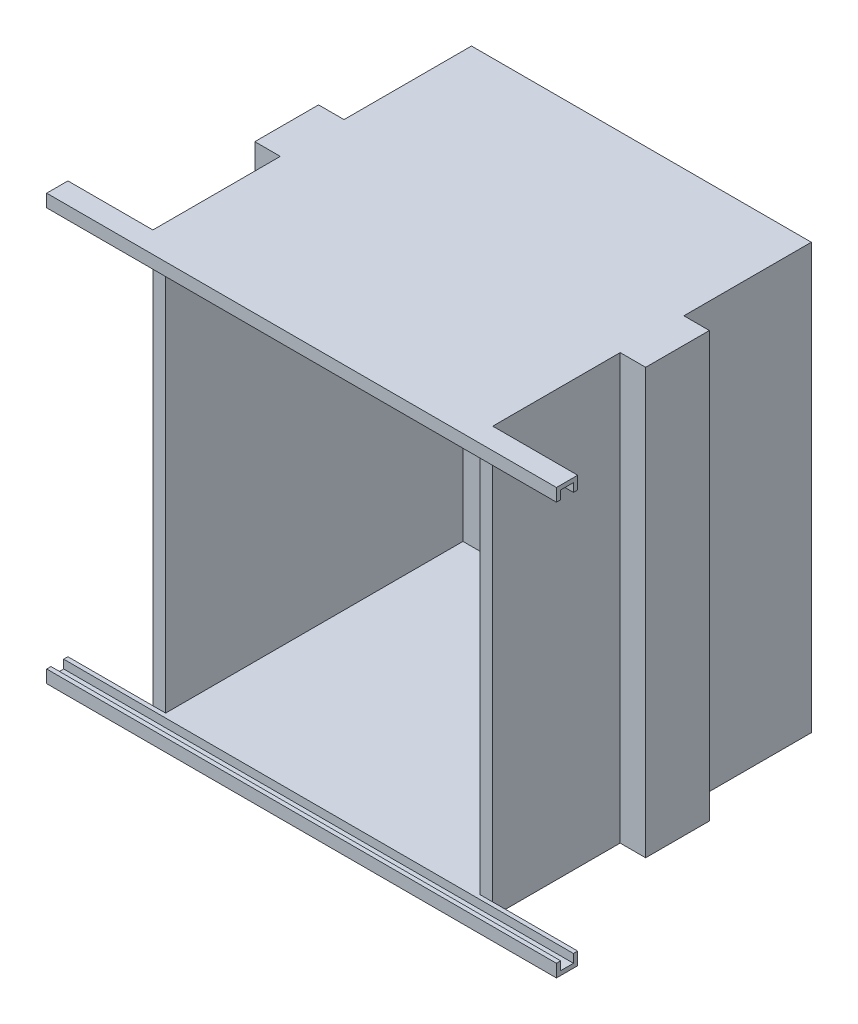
ISO-10303-21;
HEADER;
FILE_DESCRIPTION(('STEP AP214'),'2;1');
FILE_NAME('part.step','',(''),(''),'','','');
FILE_SCHEMA(('AUTOMOTIVE_DESIGN { 1 0 10303 214 1 1 1 1 }'));
ENDSEC;
DATA;
#1=APPLICATION_CONTEXT('core data for automotive mechanical design processes');
#2=APPLICATION_PROTOCOL_DEFINITION('international standard','automotive_design',2000,#1);
#3=PRODUCT_CONTEXT('',#1,'mechanical');
#4=PRODUCT('Part','Part','',(#3));
#5=PRODUCT_RELATED_PRODUCT_CATEGORY('part','',(#4));
#6=PRODUCT_DEFINITION_FORMATION('','',#4);
#7=PRODUCT_DEFINITION_CONTEXT('part definition',#1,'design');
#8=PRODUCT_DEFINITION('design','',#6,#7);
#9=PRODUCT_DEFINITION_SHAPE('','',#8);
#10=(LENGTH_UNIT() NAMED_UNIT(*) SI_UNIT(.MILLI.,.METRE.));
#11=(NAMED_UNIT(*) PLANE_ANGLE_UNIT() SI_UNIT($,.RADIAN.));
#12=(NAMED_UNIT(*) SI_UNIT($,.STERADIAN.) SOLID_ANGLE_UNIT());
#13=UNCERTAINTY_MEASURE_WITH_UNIT(LENGTH_MEASURE(1.E-05),#10,'distance_accuracy_value','');
#14=(GEOMETRIC_REPRESENTATION_CONTEXT(3) GLOBAL_UNCERTAINTY_ASSIGNED_CONTEXT((#13)) GLOBAL_UNIT_ASSIGNED_CONTEXT((#10,
#11,#12)) REPRESENTATION_CONTEXT('',''));
#15=CARTESIAN_POINT('',(0.,0.,0.));
#16=DIRECTION('',(0.,0.,1.));
#17=DIRECTION('',(1.,0.,0.));
#18=AXIS2_PLACEMENT_3D('',#15,#16,#17);
#19=CARTESIAN_POINT('',(80.,0.,5.));
#20=DIRECTION('',(-1.,0.,0.));
#21=DIRECTION('',(0.,0.,1.));
#22=AXIS2_PLACEMENT_3D('',#19,#20,#21);
#23=PLANE('',#22);
#24=DIRECTION('',(0.,0.,-1.));
#25=VECTOR('',#24,1.);
#26=CARTESIAN_POINT('',(80.,100.,5.));
#27=LINE('',#26,#25);
#28=CARTESIAN_POINT('',(80.,100.,30.));
#29=VERTEX_POINT('',#28);
#30=CARTESIAN_POINT('',(80.,100.,0.));
#31=VERTEX_POINT('',#30);
#32=EDGE_CURVE('E37',#29,#31,#27,.T.);
#33=ORIENTED_EDGE('',*,*,#32,.F.);
#34=DIRECTION('',(0.,1.,0.));
#35=VECTOR('',#34,1.);
#36=CARTESIAN_POINT('',(80.,-16.1554944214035,30.));
#37=LINE('',#36,#35);
#38=CARTESIAN_POINT('',(80.,0.,30.));
#39=VERTEX_POINT('',#38);
#40=EDGE_CURVE('E961',#39,#29,#37,.T.);
#41=ORIENTED_EDGE('',*,*,#40,.F.);
#42=DIRECTION('',(0.,0.,-1.));
#43=VECTOR('',#42,1.);
#44=CARTESIAN_POINT('',(80.,0.,5.));
#45=LINE('',#44,#43);
#46=CARTESIAN_POINT('',(80.,0.,0.));
#47=VERTEX_POINT('',#46);
#48=EDGE_CURVE('E285',#39,#47,#45,.T.);
#49=ORIENTED_EDGE('',*,*,#48,.T.);
#50=DIRECTION('',(0.,1.,0.));
#51=VECTOR('',#50,1.);
#52=CARTESIAN_POINT('',(80.,0.,0.));
#53=LINE('',#52,#51);
#54=EDGE_CURVE('E321',#47,#31,#53,.T.);
#55=ORIENTED_EDGE('',*,*,#54,.T.);
#56=EDGE_LOOP('',(#33,#41,#49,#55));
#57=FACE_BOUND('',#56,.T.);
#58=ADVANCED_FACE('F33',(#57),#23,.F.);
#59=CARTESIAN_POINT('',(0.,0.,5.));
#60=DIRECTION('',(1.,0.,0.));
#61=DIRECTION('',(0.,0.,-1.));
#62=AXIS2_PLACEMENT_3D('',#59,#60,#61);
#63=PLANE('',#62);
#64=DIRECTION('',(0.,0.,-1.));
#65=VECTOR('',#64,1.);
#66=CARTESIAN_POINT('',(0.,100.,5.));
#67=LINE('',#66,#65);
#68=CARTESIAN_POINT('',(0.,100.,75.));
#69=VERTEX_POINT('',#68);
#70=CARTESIAN_POINT('',(0.,100.,45.));
#71=VERTEX_POINT('',#70);
#72=EDGE_CURVE('E288',#69,#71,#67,.T.);
#73=ORIENTED_EDGE('',*,*,#72,.T.);
#74=DIRECTION('',(0.,1.,0.));
#75=VECTOR('',#74,1.);
#76=CARTESIAN_POINT('',(0.,-16.1554944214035,45.));
#77=LINE('',#76,#75);
#78=CARTESIAN_POINT('',(0.,0.,45.));
#79=VERTEX_POINT('',#78);
#80=EDGE_CURVE('E478',#79,#71,#77,.T.);
#81=ORIENTED_EDGE('',*,*,#80,.F.);
#82=DIRECTION('',(0.,0.,-1.));
#83=VECTOR('',#82,1.);
#84=CARTESIAN_POINT('',(0.,0.,5.));
#85=LINE('',#84,#83);
#86=CARTESIAN_POINT('',(0.,0.,75.));
#87=VERTEX_POINT('',#86);
#88=EDGE_CURVE('E43',#87,#79,#85,.T.);
#89=ORIENTED_EDGE('',*,*,#88,.F.);
#90=DIRECTION('',(0.,-1.,0.));
#91=VECTOR('',#90,1.);
#92=CARTESIAN_POINT('',(0.,3.,75.));
#93=LINE('',#92,#91);
#94=CARTESIAN_POINT('',(0.,3.,75.));
#95=VERTEX_POINT('',#94);
#96=EDGE_CURVE('E532',#95,#87,#93,.T.);
#97=ORIENTED_EDGE('',*,*,#96,.F.);
#98=DIRECTION('',(0.,-1.,0.));
#99=VECTOR('',#98,1.);
#100=CARTESIAN_POINT('',(0.,100.,75.));
#101=LINE('',#100,#99);
#102=CARTESIAN_POINT('',(0.,97.,75.));
#103=VERTEX_POINT('',#102);
#104=EDGE_CURVE('E305',#103,#95,#101,.T.);
#105=ORIENTED_EDGE('',*,*,#104,.F.);
#106=DIRECTION('',(0.,-1.,0.));
#107=VECTOR('',#106,1.);
#108=CARTESIAN_POINT('',(0.,100.,75.));
#109=LINE('',#108,#107);
#110=EDGE_CURVE('E341',#69,#103,#109,.T.);
#111=ORIENTED_EDGE('',*,*,#110,.F.);
#112=EDGE_LOOP('',(#73,#81,#89,#97,#105,#111));
#113=FACE_BOUND('',#112,.T.);
#114=ADVANCED_FACE('F457',(#113),#63,.F.);
#115=CARTESIAN_POINT('',(3.,97.,75.));
#116=DIRECTION('',(0.,-1.,0.));
#117=DIRECTION('',(0.,0.,-1.));
#118=AXIS2_PLACEMENT_3D('',#115,#116,#117);
#119=PLANE('',#118);
#120=DIRECTION('',(-1.,0.,0.));
#121=VECTOR('',#120,1.);
#122=CARTESIAN_POINT('',(100.000025,97.,76.));
#123=LINE('',#122,#121);
#124=CARTESIAN_POINT('',(100.,97.,76.));
#125=VERTEX_POINT('',#124);
#126=CARTESIAN_POINT('',(-20.,97.,76.));
#127=VERTEX_POINT('',#126);
#128=EDGE_CURVE('E495',#125,#127,#123,.T.);
#129=ORIENTED_EDGE('',*,*,#128,.T.);
#130=DIRECTION('',(0.,0.,1.));
#131=VECTOR('',#130,1.);
#132=CARTESIAN_POINT('',(-20.,97.,80.));
#133=LINE('',#132,#131);
#134=CARTESIAN_POINT('',(-20.,97.,75.));
#135=VERTEX_POINT('',#134);
#136=EDGE_CURVE('E340',#135,#127,#133,.T.);
#137=ORIENTED_EDGE('',*,*,#136,.F.);
#138=DIRECTION('',(1.,0.,0.));
#139=VECTOR('',#138,1.);
#140=CARTESIAN_POINT('',(-20.,97.,75.));
#141=LINE('',#140,#139);
#142=EDGE_CURVE('E335',#135,#103,#141,.T.);
#143=ORIENTED_EDGE('',*,*,#142,.T.);
#144=DIRECTION('',(1.,0.,0.));
#145=VECTOR('',#144,1.);
#146=CARTESIAN_POINT('',(0.,97.,75.));
#147=LINE('',#146,#145);
#148=CARTESIAN_POINT('',(3.,97.,75.));
#149=VERTEX_POINT('',#148);
#150=EDGE_CURVE('E386',#103,#149,#147,.T.);
#151=ORIENTED_EDGE('',*,*,#150,.T.);
#152=DIRECTION('',(0.,0.,-1.));
#153=VECTOR('',#152,1.);
#154=CARTESIAN_POINT('',(3.,97.,75.));
#155=LINE('',#154,#153);
#156=CARTESIAN_POINT('',(3.,97.,5.));
#157=VERTEX_POINT('',#156);
#158=EDGE_CURVE('E415',#149,#157,#155,.T.);
#159=ORIENTED_EDGE('',*,*,#158,.T.);
#160=DIRECTION('',(-1.,0.,0.));
#161=VECTOR('',#160,1.);
#162=CARTESIAN_POINT('',(3.,97.,5.));
#163=LINE('',#162,#161);
#164=CARTESIAN_POINT('',(77.,97.,5.));
#165=VERTEX_POINT('',#164);
#166=EDGE_CURVE('E406',#165,#157,#163,.T.);
#167=ORIENTED_EDGE('',*,*,#166,.F.);
#168=DIRECTION('',(0.,0.,-1.));
#169=VECTOR('',#168,1.);
#170=CARTESIAN_POINT('',(77.,97.,75.));
#171=LINE('',#170,#169);
#172=CARTESIAN_POINT('',(77.,97.,75.));
#173=VERTEX_POINT('',#172);
#174=EDGE_CURVE('E410',#173,#165,#171,.T.);
#175=ORIENTED_EDGE('',*,*,#174,.F.);
#176=CARTESIAN_POINT('',(80.,97.,75.));
#177=VERTEX_POINT('',#176);
#178=EDGE_CURVE('E11',#173,#177,#147,.T.);
#179=ORIENTED_EDGE('',*,*,#178,.T.);
#180=DIRECTION('',(-1.,0.,0.));
#181=VECTOR('',#180,1.);
#182=CARTESIAN_POINT('',(100.,97.,75.));
#183=LINE('',#182,#181);
#184=CARTESIAN_POINT('',(100.,97.,75.));
#185=VERTEX_POINT('',#184);
#186=EDGE_CURVE('E590',#185,#177,#183,.T.);
#187=ORIENTED_EDGE('',*,*,#186,.F.);
#188=DIRECTION('',(0.,0.,-1.));
#189=VECTOR('',#188,1.);
#190=CARTESIAN_POINT('',(100.,97.,80.));
#191=LINE('',#190,#189);
#192=EDGE_CURVE('E371',#125,#185,#191,.T.);
#193=ORIENTED_EDGE('',*,*,#192,.F.);
#194=EDGE_LOOP('',(#129,#137,#143,#151,#159,#167,#175,#179,#187,#193));
#195=FACE_BOUND('',#194,.T.);
#196=ADVANCED_FACE('F447',(#195),#119,.T.);
#197=CARTESIAN_POINT('',(3.00000000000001,3.,75.));
#198=DIRECTION('',(0.,1.,0.));
#199=DIRECTION('',(0.,0.,1.));
#200=AXIS2_PLACEMENT_3D('',#197,#198,#199);
#201=PLANE('',#200);
#202=DIRECTION('',(-1.,0.,0.));
#203=VECTOR('',#202,1.);
#204=CARTESIAN_POINT('',(100.000025,3.,76.));
#205=LINE('',#204,#203);
#206=CARTESIAN_POINT('',(100.,3.,76.));
#207=VERTEX_POINT('',#206);
#208=CARTESIAN_POINT('',(-20.,3.,76.));
#209=VERTEX_POINT('',#208);
#210=EDGE_CURVE('E517',#207,#209,#205,.T.);
#211=ORIENTED_EDGE('',*,*,#210,.F.);
#212=DIRECTION('',(0.,0.,1.));
#213=VECTOR('',#212,1.);
#214=CARTESIAN_POINT('',(100.,3.,80.));
#215=LINE('',#214,#213);
#216=CARTESIAN_POINT('',(100.,3.,75.));
#217=VERTEX_POINT('',#216);
#218=EDGE_CURVE('E359',#217,#207,#215,.T.);
#219=ORIENTED_EDGE('',*,*,#218,.F.);
#220=DIRECTION('',(-1.,0.,0.));
#221=VECTOR('',#220,1.);
#222=CARTESIAN_POINT('',(100.,3.,75.));
#223=LINE('',#222,#221);
#224=CARTESIAN_POINT('',(80.,3.,75.));
#225=VERTEX_POINT('',#224);
#226=EDGE_CURVE('E362',#217,#225,#223,.T.);
#227=ORIENTED_EDGE('',*,*,#226,.T.);
#228=DIRECTION('',(-1.,0.,0.));
#229=VECTOR('',#228,1.);
#230=CARTESIAN_POINT('',(0.,3.,75.));
#231=LINE('',#230,#229);
#232=CARTESIAN_POINT('',(77.,3.,75.));
#233=VERTEX_POINT('',#232);
#234=EDGE_CURVE('E384',#225,#233,#231,.T.);
#235=ORIENTED_EDGE('',*,*,#234,.T.);
#236=DIRECTION('',(0.,0.,-1.));
#237=VECTOR('',#236,1.);
#238=CARTESIAN_POINT('',(77.,3.,75.));
#239=LINE('',#238,#237);
#240=CARTESIAN_POINT('',(77.,3.,5.));
#241=VERTEX_POINT('',#240);
#242=EDGE_CURVE('E409',#233,#241,#239,.T.);
#243=ORIENTED_EDGE('',*,*,#242,.T.);
#244=DIRECTION('',(1.,0.,0.));
#245=VECTOR('',#244,1.);
#246=CARTESIAN_POINT('',(3.00000000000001,3.,5.));
#247=LINE('',#246,#245);
#248=CARTESIAN_POINT('',(3.00000000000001,3.,5.));
#249=VERTEX_POINT('',#248);
#250=EDGE_CURVE('E400',#249,#241,#247,.T.);
#251=ORIENTED_EDGE('',*,*,#250,.F.);
#252=DIRECTION('',(0.,0.,-1.));
#253=VECTOR('',#252,1.);
#254=CARTESIAN_POINT('',(3.00000000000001,3.,75.));
#255=LINE('',#254,#253);
#256=CARTESIAN_POINT('',(3.00000000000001,3.,75.));
#257=VERTEX_POINT('',#256);
#258=EDGE_CURVE('E308',#257,#249,#255,.T.);
#259=ORIENTED_EDGE('',*,*,#258,.F.);
#260=EDGE_CURVE('E388',#257,#95,#231,.T.);
#261=ORIENTED_EDGE('',*,*,#260,.T.);
#262=DIRECTION('',(1.,0.,0.));
#263=VECTOR('',#262,1.);
#264=CARTESIAN_POINT('',(-20.,3.,75.));
#265=LINE('',#264,#263);
#266=CARTESIAN_POINT('',(-20.,3.,75.));
#267=VERTEX_POINT('',#266);
#268=EDGE_CURVE('E345',#267,#95,#265,.T.);
#269=ORIENTED_EDGE('',*,*,#268,.F.);
#270=DIRECTION('',(0.,0.,-1.));
#271=VECTOR('',#270,1.);
#272=CARTESIAN_POINT('',(-20.,3.,80.));
#273=LINE('',#272,#271);
#274=EDGE_CURVE('E536',#209,#267,#273,.T.);
#275=ORIENTED_EDGE('',*,*,#274,.F.);
#276=EDGE_LOOP('',(#211,#219,#227,#235,#243,#251,#259,#261,#269,#275));
#277=FACE_BOUND('',#276,.T.);
#278=ADVANCED_FACE('F441',(#277),#201,.T.);
#279=CARTESIAN_POINT('',(0.,0.,30.));
#280=VERTEX_POINT('',#279);
#281=CARTESIAN_POINT('',(0.,0.,0.));
#282=VERTEX_POINT('',#281);
#283=EDGE_CURVE('E59',#280,#282,#85,.T.);
#284=ORIENTED_EDGE('',*,*,#283,.F.);
#285=DIRECTION('',(0.,1.,0.));
#286=VECTOR('',#285,1.);
#287=CARTESIAN_POINT('',(0.,-16.1554944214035,30.));
#288=LINE('',#287,#286);
#289=CARTESIAN_POINT('',(0.,100.,30.));
#290=VERTEX_POINT('',#289);
#291=EDGE_CURVE('E470',#280,#290,#288,.T.);
#292=ORIENTED_EDGE('',*,*,#291,.T.);
#293=CARTESIAN_POINT('',(0.,100.,0.));
#294=VERTEX_POINT('',#293);
#295=EDGE_CURVE('E324',#290,#294,#67,.T.);
#296=ORIENTED_EDGE('',*,*,#295,.T.);
#297=DIRECTION('',(0.,-1.,0.));
#298=VECTOR('',#297,1.);
#299=CARTESIAN_POINT('',(0.,0.,0.));
#300=LINE('',#299,#298);
#301=EDGE_CURVE('E316',#294,#282,#300,.T.);
#302=ORIENTED_EDGE('',*,*,#301,.T.);
#303=EDGE_LOOP('',(#284,#292,#296,#302));
#304=FACE_BOUND('',#303,.T.);
#305=ADVANCED_FACE('F35',(#304),#63,.F.);
#306=CARTESIAN_POINT('',(80.,0.,75.));
#307=VERTEX_POINT('',#306);
#308=CARTESIAN_POINT('',(80.,0.,45.));
#309=VERTEX_POINT('',#308);
#310=EDGE_CURVE('E277',#307,#309,#45,.T.);
#311=ORIENTED_EDGE('',*,*,#310,.T.);
#312=DIRECTION('',(0.,1.,0.));
#313=VECTOR('',#312,1.);
#314=CARTESIAN_POINT('',(80.,-16.1554944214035,45.));
#315=LINE('',#314,#313);
#316=CARTESIAN_POINT('',(80.,100.,45.));
#317=VERTEX_POINT('',#316);
#318=EDGE_CURVE('E263',#309,#317,#315,.T.);
#319=ORIENTED_EDGE('',*,*,#318,.T.);
#320=CARTESIAN_POINT('',(80.,100.,75.));
#321=VERTEX_POINT('',#320);
#322=EDGE_CURVE('E273',#321,#317,#27,.T.);
#323=ORIENTED_EDGE('',*,*,#322,.F.);
#324=DIRECTION('',(0.,1.,0.));
#325=VECTOR('',#324,1.);
#326=CARTESIAN_POINT('',(80.,100.,75.));
#327=LINE('',#326,#325);
#328=EDGE_CURVE('E294',#177,#321,#327,.T.);
#329=ORIENTED_EDGE('',*,*,#328,.F.);
#330=DIRECTION('',(0.,1.,0.));
#331=VECTOR('',#330,1.);
#332=CARTESIAN_POINT('',(80.,100.,75.));
#333=LINE('',#332,#331);
#334=EDGE_CURVE('E291',#225,#177,#333,.T.);
#335=ORIENTED_EDGE('',*,*,#334,.F.);
#336=DIRECTION('',(0.,1.,0.));
#337=VECTOR('',#336,1.);
#338=CARTESIAN_POINT('',(80.,3.,75.));
#339=LINE('',#338,#337);
#340=EDGE_CURVE('E334',#307,#225,#339,.T.);
#341=ORIENTED_EDGE('',*,*,#340,.F.);
#342=EDGE_LOOP('',(#311,#319,#323,#329,#335,#341));
#343=FACE_BOUND('',#342,.T.);
#344=ADVANCED_FACE('F272',(#343),#23,.F.);
#345=CARTESIAN_POINT('',(0.,0.,75.));
#346=DIRECTION('',(0.,0.,1.));
#347=DIRECTION('',(1.,0.,0.));
#348=AXIS2_PLACEMENT_3D('',#345,#346,#347);
#349=PLANE('',#348);
#350=ORIENTED_EDGE('',*,*,#104,.T.);
#351=ORIENTED_EDGE('',*,*,#260,.F.);
#352=DIRECTION('',(0.,-1.,0.));
#353=VECTOR('',#352,1.);
#354=CARTESIAN_POINT('',(3.,97.,75.));
#355=LINE('',#354,#353);
#356=EDGE_CURVE('E408',#149,#257,#355,.T.);
#357=ORIENTED_EDGE('',*,*,#356,.F.);
#358=ORIENTED_EDGE('',*,*,#150,.F.);
#359=EDGE_LOOP('',(#350,#351,#357,#358));
#360=FACE_BOUND('',#359,.T.);
#361=ADVANCED_FACE('F450',(#360),#349,.T.);
#362=DIRECTION('',(0.,1.,0.));
#363=VECTOR('',#362,1.);
#364=CARTESIAN_POINT('',(77.,97.,75.));
#365=LINE('',#364,#363);
#366=EDGE_CURVE('E420',#233,#173,#365,.T.);
#367=ORIENTED_EDGE('',*,*,#366,.F.);
#368=ORIENTED_EDGE('',*,*,#234,.F.);
#369=ORIENTED_EDGE('',*,*,#334,.T.);
#370=ORIENTED_EDGE('',*,*,#178,.F.);
#371=EDGE_LOOP('',(#367,#368,#369,#370));
#372=FACE_BOUND('',#371,.T.);
#373=ADVANCED_FACE('F598',(#372),#349,.T.);
#374=CARTESIAN_POINT('',(0.,0.,5.));
#375=DIRECTION('',(0.,1.,0.));
#376=DIRECTION('',(0.,0.,1.));
#377=AXIS2_PLACEMENT_3D('',#374,#375,#376);
#378=PLANE('',#377);
#379=DIRECTION('',(1.,0.,0.));
#380=VECTOR('',#379,1.);
#381=CARTESIAN_POINT('',(0.,0.,0.));
#382=LINE('',#381,#380);
#383=EDGE_CURVE('E318',#282,#47,#382,.T.);
#384=ORIENTED_EDGE('',*,*,#383,.T.);
#385=ORIENTED_EDGE('',*,*,#48,.F.);
#386=DIRECTION('',(1.,0.,0.));
#387=VECTOR('',#386,1.);
#388=CARTESIAN_POINT('',(80.,0.,30.));
#389=LINE('',#388,#387);
#390=CARTESIAN_POINT('',(86.,0.,30.));
#391=VERTEX_POINT('',#390);
#392=EDGE_CURVE('E611',#39,#391,#389,.T.);
#393=ORIENTED_EDGE('',*,*,#392,.T.);
#394=DIRECTION('',(0.,0.,1.));
#395=VECTOR('',#394,1.);
#396=CARTESIAN_POINT('',(86.,0.,30.));
#397=LINE('',#396,#395);
#398=CARTESIAN_POINT('',(86.,0.,45.));
#399=VERTEX_POINT('',#398);
#400=EDGE_CURVE('E610',#391,#399,#397,.T.);
#401=ORIENTED_EDGE('',*,*,#400,.T.);
#402=DIRECTION('',(-1.,0.,0.));
#403=VECTOR('',#402,1.);
#404=CARTESIAN_POINT('',(80.,0.,45.));
#405=LINE('',#404,#403);
#406=EDGE_CURVE('E608',#399,#309,#405,.T.);
#407=ORIENTED_EDGE('',*,*,#406,.T.);
#408=ORIENTED_EDGE('',*,*,#310,.F.);
#409=DIRECTION('',(-1.,0.,0.));
#410=VECTOR('',#409,1.);
#411=CARTESIAN_POINT('',(100.,0.,75.));
#412=LINE('',#411,#410);
#413=CARTESIAN_POINT('',(100.,0.,75.));
#414=VERTEX_POINT('',#413);
#415=EDGE_CURVE('E366',#414,#307,#412,.T.);
#416=ORIENTED_EDGE('',*,*,#415,.F.);
#417=DIRECTION('',(0.,0.,-1.));
#418=VECTOR('',#417,1.);
#419=CARTESIAN_POINT('',(100.,0.,80.));
#420=LINE('',#419,#418);
#421=CARTESIAN_POINT('',(100.,0.,80.));
#422=VERTEX_POINT('',#421);
#423=EDGE_CURVE('E354',#422,#414,#420,.T.);
#424=ORIENTED_EDGE('',*,*,#423,.F.);
#425=DIRECTION('',(1.,0.,0.));
#426=VECTOR('',#425,1.);
#427=CARTESIAN_POINT('',(0.,0.,80.));
#428=LINE('',#427,#426);
#429=CARTESIAN_POINT('',(-20.,0.,80.));
#430=VERTEX_POINT('',#429);
#431=EDGE_CURVE('E381',#430,#422,#428,.T.);
#432=ORIENTED_EDGE('',*,*,#431,.F.);
#433=DIRECTION('',(0.,0.,1.));
#434=VECTOR('',#433,1.);
#435=CARTESIAN_POINT('',(-20.,0.,80.));
#436=LINE('',#435,#434);
#437=CARTESIAN_POINT('',(-20.,0.,75.));
#438=VERTEX_POINT('',#437);
#439=EDGE_CURVE('E542',#438,#430,#436,.T.);
#440=ORIENTED_EDGE('',*,*,#439,.F.);
#441=DIRECTION('',(1.,0.,0.));
#442=VECTOR('',#441,1.);
#443=CARTESIAN_POINT('',(-20.,0.,75.));
#444=LINE('',#443,#442);
#445=EDGE_CURVE('E545',#438,#87,#444,.T.);
#446=ORIENTED_EDGE('',*,*,#445,.T.);
#447=ORIENTED_EDGE('',*,*,#88,.T.);
#448=DIRECTION('',(-1.,0.,0.));
#449=VECTOR('',#448,1.);
#450=CARTESIAN_POINT('',(0.,0.,45.));
#451=LINE('',#450,#449);
#452=CARTESIAN_POINT('',(-6.00000000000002,0.,45.));
#453=VERTEX_POINT('',#452);
#454=EDGE_CURVE('E487',#79,#453,#451,.T.);
#455=ORIENTED_EDGE('',*,*,#454,.T.);
#456=DIRECTION('',(0.,0.,-1.));
#457=VECTOR('',#456,1.);
#458=CARTESIAN_POINT('',(-6.00000000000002,0.,30.));
#459=LINE('',#458,#457);
#460=CARTESIAN_POINT('',(-6.00000000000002,0.,30.));
#461=VERTEX_POINT('',#460);
#462=EDGE_CURVE('E480',#453,#461,#459,.T.);
#463=ORIENTED_EDGE('',*,*,#462,.T.);
#464=DIRECTION('',(1.,0.,0.));
#465=VECTOR('',#464,1.);
#466=CARTESIAN_POINT('',(0.,0.,30.));
#467=LINE('',#466,#465);
#468=EDGE_CURVE('E484',#461,#280,#467,.T.);
#469=ORIENTED_EDGE('',*,*,#468,.T.);
#470=ORIENTED_EDGE('',*,*,#283,.T.);
#471=EDGE_LOOP('',(#384,#385,#393,#401,#407,#408,#416,#424,#432,#440,#446,#447,#455,#463,#469,#470));
#472=FACE_BOUND('',#471,.T.);
#473=ADVANCED_FACE('F605',(#472),#378,.F.);
#474=CARTESIAN_POINT('',(0.,100.,5.));
#475=DIRECTION('',(0.,-1.,0.));
#476=DIRECTION('',(0.,0.,-1.));
#477=AXIS2_PLACEMENT_3D('',#474,#475,#476);
#478=PLANE('',#477);
#479=DIRECTION('',(-1.,0.,0.));
#480=VECTOR('',#479,1.);
#481=CARTESIAN_POINT('',(0.,100.,0.));
#482=LINE('',#481,#480);
#483=EDGE_CURVE('E323',#31,#294,#482,.T.);
#484=ORIENTED_EDGE('',*,*,#483,.T.);
#485=ORIENTED_EDGE('',*,*,#295,.F.);
#486=DIRECTION('',(-1.,0.,0.));
#487=VECTOR('',#486,1.);
#488=CARTESIAN_POINT('',(0.,100.,30.));
#489=LINE('',#488,#487);
#490=CARTESIAN_POINT('',(-6.00000000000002,100.,30.));
#491=VERTEX_POINT('',#490);
#492=EDGE_CURVE('E474',#290,#491,#489,.T.);
#493=ORIENTED_EDGE('',*,*,#492,.T.);
#494=DIRECTION('',(0.,0.,1.));
#495=VECTOR('',#494,1.);
#496=CARTESIAN_POINT('',(-6.00000000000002,100.,30.));
#497=LINE('',#496,#495);
#498=CARTESIAN_POINT('',(-6.00000000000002,100.,45.));
#499=VERTEX_POINT('',#498);
#500=EDGE_CURVE('E467',#491,#499,#497,.T.);
#501=ORIENTED_EDGE('',*,*,#500,.T.);
#502=DIRECTION('',(1.,0.,0.));
#503=VECTOR('',#502,1.);
#504=CARTESIAN_POINT('',(0.,100.,45.));
#505=LINE('',#504,#503);
#506=EDGE_CURVE('E464',#499,#71,#505,.T.);
#507=ORIENTED_EDGE('',*,*,#506,.T.);
#508=ORIENTED_EDGE('',*,*,#72,.F.);
#509=DIRECTION('',(1.,0.,0.));
#510=VECTOR('',#509,1.);
#511=CARTESIAN_POINT('',(-20.,100.,75.));
#512=LINE('',#511,#510);
#513=CARTESIAN_POINT('',(-20.,100.,75.));
#514=VERTEX_POINT('',#513);
#515=EDGE_CURVE('E331',#514,#69,#512,.T.);
#516=ORIENTED_EDGE('',*,*,#515,.F.);
#517=DIRECTION('',(0.,0.,-1.));
#518=VECTOR('',#517,1.);
#519=CARTESIAN_POINT('',(-20.,100.,80.));
#520=LINE('',#519,#518);
#521=CARTESIAN_POINT('',(-20.,100.,80.));
#522=VERTEX_POINT('',#521);
#523=EDGE_CURVE('E552',#522,#514,#520,.T.);
#524=ORIENTED_EDGE('',*,*,#523,.F.);
#525=DIRECTION('',(-1.,0.,0.));
#526=VECTOR('',#525,1.);
#527=CARTESIAN_POINT('',(0.,100.,80.));
#528=LINE('',#527,#526);
#529=CARTESIAN_POINT('',(100.,100.,80.));
#530=VERTEX_POINT('',#529);
#531=EDGE_CURVE('E391',#530,#522,#528,.T.);
#532=ORIENTED_EDGE('',*,*,#531,.F.);
#533=DIRECTION('',(0.,0.,1.));
#534=VECTOR('',#533,1.);
#535=CARTESIAN_POINT('',(100.,100.,80.));
#536=LINE('',#535,#534);
#537=CARTESIAN_POINT('',(100.,100.,75.));
#538=VERTEX_POINT('',#537);
#539=EDGE_CURVE('E377',#538,#530,#536,.T.);
#540=ORIENTED_EDGE('',*,*,#539,.F.);
#541=DIRECTION('',(-1.,0.,0.));
#542=VECTOR('',#541,1.);
#543=CARTESIAN_POINT('',(100.,100.,75.));
#544=LINE('',#543,#542);
#545=EDGE_CURVE('E284',#538,#321,#544,.T.);
#546=ORIENTED_EDGE('',*,*,#545,.T.);
#547=ORIENTED_EDGE('',*,*,#322,.T.);
#548=DIRECTION('',(1.,0.,0.));
#549=VECTOR('',#548,1.);
#550=CARTESIAN_POINT('',(80.,100.,45.));
#551=LINE('',#550,#549);
#552=CARTESIAN_POINT('',(86.,100.,45.));
#553=VERTEX_POINT('',#552);
#554=EDGE_CURVE('E259',#317,#553,#551,.T.);
#555=ORIENTED_EDGE('',*,*,#554,.T.);
#556=DIRECTION('',(0.,0.,-1.));
#557=VECTOR('',#556,1.);
#558=CARTESIAN_POINT('',(86.,100.,30.));
#559=LINE('',#558,#557);
#560=CARTESIAN_POINT('',(86.,100.,30.));
#561=VERTEX_POINT('',#560);
#562=EDGE_CURVE('E269',#553,#561,#559,.T.);
#563=ORIENTED_EDGE('',*,*,#562,.T.);
#564=DIRECTION('',(-1.,0.,0.));
#565=VECTOR('',#564,1.);
#566=CARTESIAN_POINT('',(80.,100.,30.));
#567=LINE('',#566,#565);
#568=EDGE_CURVE('E51',#561,#29,#567,.T.);
#569=ORIENTED_EDGE('',*,*,#568,.T.);
#570=ORIENTED_EDGE('',*,*,#32,.T.);
#571=EDGE_LOOP('',(#484,#485,#493,#501,#507,#508,#516,#524,#532,#540,#546,#547,#555,#563,#569,#570));
#572=FACE_BOUND('',#571,.T.);
#573=ADVANCED_FACE('F281',(#572),#478,.F.);
#574=CARTESIAN_POINT('',(0.,0.,0.));
#575=DIRECTION('',(0.,0.,-1.));
#576=DIRECTION('',(-1.,0.,0.));
#577=AXIS2_PLACEMENT_3D('',#574,#575,#576);
#578=PLANE('',#577);
#579=ORIENTED_EDGE('',*,*,#301,.F.);
#580=ORIENTED_EDGE('',*,*,#483,.F.);
#581=ORIENTED_EDGE('',*,*,#54,.F.);
#582=ORIENTED_EDGE('',*,*,#383,.F.);
#583=EDGE_LOOP('',(#579,#580,#581,#582));
#584=FACE_BOUND('',#583,.T.);
#585=ADVANCED_FACE('F667',(#584),#578,.T.);
#586=CARTESIAN_POINT('',(3.,97.,75.));
#587=DIRECTION('',(1.,0.,0.));
#588=DIRECTION('',(0.,1.,0.));
#589=AXIS2_PLACEMENT_3D('',#586,#587,#588);
#590=PLANE('',#589);
#591=DIRECTION('',(0.,-1.,0.));
#592=VECTOR('',#591,1.);
#593=CARTESIAN_POINT('',(3.,97.,5.));
#594=LINE('',#593,#592);
#595=EDGE_CURVE('E392',#157,#249,#594,.T.);
#596=ORIENTED_EDGE('',*,*,#595,.F.);
#597=ORIENTED_EDGE('',*,*,#158,.F.);
#598=ORIENTED_EDGE('',*,*,#356,.T.);
#599=ORIENTED_EDGE('',*,*,#258,.T.);
#600=EDGE_LOOP('',(#596,#597,#598,#599));
#601=FACE_BOUND('',#600,.T.);
#602=ADVANCED_FACE('F436',(#601),#590,.T.);
#603=DIRECTION('',(-1.,0.,0.));
#604=VECTOR('',#603,1.);
#605=CARTESIAN_POINT('',(100.000025,3.,79.));
#606=LINE('',#605,#604);
#607=CARTESIAN_POINT('',(100.,3.,79.));
#608=VERTEX_POINT('',#607);
#609=CARTESIAN_POINT('',(-20.,3.,79.));
#610=VERTEX_POINT('',#609);
#611=EDGE_CURVE('E520',#608,#610,#606,.T.);
#612=ORIENTED_EDGE('',*,*,#611,.T.);
#613=CARTESIAN_POINT('',(-20.,3.,80.));
#614=VERTEX_POINT('',#613);
#615=EDGE_CURVE('E537',#614,#610,#273,.T.);
#616=ORIENTED_EDGE('',*,*,#615,.F.);
#617=DIRECTION('',(-1.,0.,0.));
#618=VECTOR('',#617,1.);
#619=CARTESIAN_POINT('',(0.,3.,80.));
#620=LINE('',#619,#618);
#621=CARTESIAN_POINT('',(100.,3.,80.));
#622=VERTEX_POINT('',#621);
#623=EDGE_CURVE('E383',#622,#614,#620,.T.);
#624=ORIENTED_EDGE('',*,*,#623,.F.);
#625=EDGE_CURVE('E358',#608,#622,#215,.T.);
#626=ORIENTED_EDGE('',*,*,#625,.F.);
#627=EDGE_LOOP('',(#612,#616,#624,#626));
#628=FACE_BOUND('',#627,.T.);
#629=ADVANCED_FACE('F653',(#628),#201,.T.);
#630=CARTESIAN_POINT('',(77.,97.,75.));
#631=DIRECTION('',(-1.,0.,0.));
#632=DIRECTION('',(0.,-1.,0.));
#633=AXIS2_PLACEMENT_3D('',#630,#631,#632);
#634=PLANE('',#633);
#635=DIRECTION('',(0.,1.,0.));
#636=VECTOR('',#635,1.);
#637=CARTESIAN_POINT('',(77.,97.,5.));
#638=LINE('',#637,#636);
#639=EDGE_CURVE('E403',#241,#165,#638,.T.);
#640=ORIENTED_EDGE('',*,*,#639,.F.);
#641=ORIENTED_EDGE('',*,*,#242,.F.);
#642=ORIENTED_EDGE('',*,*,#366,.T.);
#643=ORIENTED_EDGE('',*,*,#174,.T.);
#644=EDGE_LOOP('',(#640,#641,#642,#643));
#645=FACE_BOUND('',#644,.T.);
#646=ADVANCED_FACE('F661',(#645),#634,.T.);
#647=DIRECTION('',(-1.,0.,0.));
#648=VECTOR('',#647,1.);
#649=CARTESIAN_POINT('',(100.000025,97.,79.));
#650=LINE('',#649,#648);
#651=CARTESIAN_POINT('',(100.,97.,79.));
#652=VERTEX_POINT('',#651);
#653=CARTESIAN_POINT('',(-20.,97.,79.));
#654=VERTEX_POINT('',#653);
#655=EDGE_CURVE('E501',#652,#654,#650,.T.);
#656=ORIENTED_EDGE('',*,*,#655,.F.);
#657=CARTESIAN_POINT('',(100.,97.,80.));
#658=VERTEX_POINT('',#657);
#659=EDGE_CURVE('E372',#658,#652,#191,.T.);
#660=ORIENTED_EDGE('',*,*,#659,.F.);
#661=DIRECTION('',(1.,0.,0.));
#662=VECTOR('',#661,1.);
#663=CARTESIAN_POINT('',(0.,97.,80.));
#664=LINE('',#663,#662);
#665=CARTESIAN_POINT('',(-20.,97.,80.));
#666=VERTEX_POINT('',#665);
#667=EDGE_CURVE('E389',#666,#658,#664,.T.);
#668=ORIENTED_EDGE('',*,*,#667,.F.);
#669=EDGE_CURVE('E554',#654,#666,#133,.T.);
#670=ORIENTED_EDGE('',*,*,#669,.F.);
#671=EDGE_LOOP('',(#656,#660,#668,#670));
#672=FACE_BOUND('',#671,.T.);
#673=ADVANCED_FACE('F580',(#672),#119,.T.);
#674=CARTESIAN_POINT('',(0.,0.,5.));
#675=DIRECTION('',(0.,0.,-1.));
#676=DIRECTION('',(-1.,0.,0.));
#677=AXIS2_PLACEMENT_3D('',#674,#675,#676);
#678=PLANE('',#677);
#679=ORIENTED_EDGE('',*,*,#166,.T.);
#680=ORIENTED_EDGE('',*,*,#595,.T.);
#681=ORIENTED_EDGE('',*,*,#250,.T.);
#682=ORIENTED_EDGE('',*,*,#639,.T.);
#683=EDGE_LOOP('',(#679,#680,#681,#682));
#684=FACE_BOUND('',#683,.T.);
#685=ADVANCED_FACE('F444',(#684),#678,.F.);
#686=CARTESIAN_POINT('',(0.,0.,80.));
#687=DIRECTION('',(0.,0.,1.));
#688=DIRECTION('',(1.,0.,0.));
#689=AXIS2_PLACEMENT_3D('',#686,#687,#688);
#690=PLANE('',#689);
#691=ORIENTED_EDGE('',*,*,#531,.T.);
#692=DIRECTION('',(0.,1.,0.));
#693=VECTOR('',#692,1.);
#694=CARTESIAN_POINT('',(-20.,100.,80.));
#695=LINE('',#694,#693);
#696=EDGE_CURVE('E344',#666,#522,#695,.T.);
#697=ORIENTED_EDGE('',*,*,#696,.F.);
#698=ORIENTED_EDGE('',*,*,#667,.T.);
#699=DIRECTION('',(0.,-1.,0.));
#700=VECTOR('',#699,1.);
#701=CARTESIAN_POINT('',(100.,100.,80.));
#702=LINE('',#701,#700);
#703=EDGE_CURVE('E368',#530,#658,#702,.T.);
#704=ORIENTED_EDGE('',*,*,#703,.F.);
#705=EDGE_LOOP('',(#691,#697,#698,#704));
#706=FACE_BOUND('',#705,.T.);
#707=ADVANCED_FACE('F585',(#706),#690,.T.);
#708=CARTESIAN_POINT('',(0.,0.,80.));
#709=DIRECTION('',(0.,0.,-1.));
#710=DIRECTION('',(-1.,0.,0.));
#711=AXIS2_PLACEMENT_3D('',#708,#709,#710);
#712=PLANE('',#711);
#713=ORIENTED_EDGE('',*,*,#623,.T.);
#714=DIRECTION('',(0.,1.,0.));
#715=VECTOR('',#714,1.);
#716=CARTESIAN_POINT('',(-20.,3.,80.));
#717=LINE('',#716,#715);
#718=EDGE_CURVE('E533',#430,#614,#717,.T.);
#719=ORIENTED_EDGE('',*,*,#718,.F.);
#720=ORIENTED_EDGE('',*,*,#431,.T.);
#721=DIRECTION('',(0.,-1.,0.));
#722=VECTOR('',#721,1.);
#723=CARTESIAN_POINT('',(100.,3.,80.));
#724=LINE('',#723,#722);
#725=EDGE_CURVE('E351',#622,#422,#724,.T.);
#726=ORIENTED_EDGE('',*,*,#725,.F.);
#727=EDGE_LOOP('',(#713,#719,#720,#726));
#728=FACE_BOUND('',#727,.T.);
#729=ADVANCED_FACE('F680',(#728),#712,.F.);
#730=CARTESIAN_POINT('',(100.,100.,75.));
#731=DIRECTION('',(0.,0.,1.));
#732=DIRECTION('',(1.,0.,0.));
#733=AXIS2_PLACEMENT_3D('',#730,#731,#732);
#734=PLANE('',#733);
#735=ORIENTED_EDGE('',*,*,#328,.T.);
#736=ORIENTED_EDGE('',*,*,#545,.F.);
#737=DIRECTION('',(0.,1.,0.));
#738=VECTOR('',#737,1.);
#739=CARTESIAN_POINT('',(100.,100.,75.));
#740=LINE('',#739,#738);
#741=EDGE_CURVE('E375',#185,#538,#740,.T.);
#742=ORIENTED_EDGE('',*,*,#741,.F.);
#743=ORIENTED_EDGE('',*,*,#186,.T.);
#744=EDGE_LOOP('',(#735,#736,#742,#743));
#745=FACE_BOUND('',#744,.T.);
#746=ADVANCED_FACE('F589',(#745),#734,.F.);
#747=CARTESIAN_POINT('',(100.,0.,0.));
#748=DIRECTION('',(1.,0.,0.));
#749=DIRECTION('',(0.,0.,-1.));
#750=AXIS2_PLACEMENT_3D('',#747,#748,#749);
#751=PLANE('',#750);
#752=DIRECTION('',(0.,1.,0.));
#753=VECTOR('',#752,1.);
#754=CARTESIAN_POINT('',(100.,0.,76.));
#755=LINE('',#754,#753);
#756=CARTESIAN_POINT('',(100.,99.,76.));
#757=VERTEX_POINT('',#756);
#758=EDGE_CURVE('E507',#125,#757,#755,.T.);
#759=ORIENTED_EDGE('',*,*,#758,.F.);
#760=ORIENTED_EDGE('',*,*,#192,.T.);
#761=ORIENTED_EDGE('',*,*,#741,.T.);
#762=ORIENTED_EDGE('',*,*,#539,.T.);
#763=ORIENTED_EDGE('',*,*,#703,.T.);
#764=ORIENTED_EDGE('',*,*,#659,.T.);
#765=DIRECTION('',(0.,-1.,0.));
#766=VECTOR('',#765,1.);
#767=CARTESIAN_POINT('',(100.,0.,79.));
#768=LINE('',#767,#766);
#769=CARTESIAN_POINT('',(100.,99.,79.));
#770=VERTEX_POINT('',#769);
#771=EDGE_CURVE('E498',#770,#652,#768,.T.);
#772=ORIENTED_EDGE('',*,*,#771,.F.);
#773=DIRECTION('',(0.,0.,1.));
#774=VECTOR('',#773,1.);
#775=CARTESIAN_POINT('',(100.,99.,0.));
#776=LINE('',#775,#774);
#777=EDGE_CURVE('E505',#757,#770,#776,.T.);
#778=ORIENTED_EDGE('',*,*,#777,.F.);
#779=EDGE_LOOP('',(#759,#760,#761,#762,#763,#764,#772,#778));
#780=FACE_BOUND('',#779,.T.);
#781=ADVANCED_FACE('F571',(#780),#751,.T.);
#782=CARTESIAN_POINT('',(100.,3.,75.));
#783=DIRECTION('',(0.,0.,1.));
#784=DIRECTION('',(1.,0.,0.));
#785=AXIS2_PLACEMENT_3D('',#782,#783,#784);
#786=PLANE('',#785);
#787=ORIENTED_EDGE('',*,*,#340,.T.);
#788=ORIENTED_EDGE('',*,*,#226,.F.);
#789=DIRECTION('',(0.,1.,0.));
#790=VECTOR('',#789,1.);
#791=CARTESIAN_POINT('',(100.,3.,75.));
#792=LINE('',#791,#790);
#793=EDGE_CURVE('E356',#414,#217,#792,.T.);
#794=ORIENTED_EDGE('',*,*,#793,.F.);
#795=ORIENTED_EDGE('',*,*,#415,.T.);
#796=EDGE_LOOP('',(#787,#788,#794,#795));
#797=FACE_BOUND('',#796,.T.);
#798=ADVANCED_FACE('F714',(#797),#786,.F.);
#799=CARTESIAN_POINT('',(100.,0.,0.));
#800=DIRECTION('',(1.,0.,0.));
#801=DIRECTION('',(0.,0.,-1.));
#802=AXIS2_PLACEMENT_3D('',#799,#800,#801);
#803=PLANE('',#802);
#804=DIRECTION('',(0.,1.,0.));
#805=VECTOR('',#804,1.);
#806=CARTESIAN_POINT('',(100.,0.,76.));
#807=LINE('',#806,#805);
#808=CARTESIAN_POINT('',(100.,1.,76.));
#809=VERTEX_POINT('',#808);
#810=EDGE_CURVE('E530',#809,#207,#807,.T.);
#811=ORIENTED_EDGE('',*,*,#810,.F.);
#812=DIRECTION('',(0.,0.,-1.));
#813=VECTOR('',#812,1.);
#814=CARTESIAN_POINT('',(100.,1.,0.));
#815=LINE('',#814,#813);
#816=CARTESIAN_POINT('',(100.,1.,79.));
#817=VERTEX_POINT('',#816);
#818=EDGE_CURVE('E519',#817,#809,#815,.T.);
#819=ORIENTED_EDGE('',*,*,#818,.F.);
#820=DIRECTION('',(0.,-1.,0.));
#821=VECTOR('',#820,1.);
#822=CARTESIAN_POINT('',(100.,0.,79.));
#823=LINE('',#822,#821);
#824=EDGE_CURVE('E528',#608,#817,#823,.T.);
#825=ORIENTED_EDGE('',*,*,#824,.F.);
#826=ORIENTED_EDGE('',*,*,#625,.T.);
#827=ORIENTED_EDGE('',*,*,#725,.T.);
#828=ORIENTED_EDGE('',*,*,#423,.T.);
#829=ORIENTED_EDGE('',*,*,#793,.T.);
#830=ORIENTED_EDGE('',*,*,#218,.T.);
#831=EDGE_LOOP('',(#811,#819,#825,#826,#827,#828,#829,#830));
#832=FACE_BOUND('',#831,.T.);
#833=ADVANCED_FACE('F684',(#832),#803,.T.);
#834=CARTESIAN_POINT('',(-20.,100.,75.));
#835=DIRECTION('',(0.,0.,1.));
#836=DIRECTION('',(1.,0.,0.));
#837=AXIS2_PLACEMENT_3D('',#834,#835,#836);
#838=PLANE('',#837);
#839=ORIENTED_EDGE('',*,*,#110,.T.);
#840=ORIENTED_EDGE('',*,*,#142,.F.);
#841=DIRECTION('',(0.,-1.,0.));
#842=VECTOR('',#841,1.);
#843=CARTESIAN_POINT('',(-20.,100.,75.));
#844=LINE('',#843,#842);
#845=EDGE_CURVE('E553',#514,#135,#844,.T.);
#846=ORIENTED_EDGE('',*,*,#845,.F.);
#847=ORIENTED_EDGE('',*,*,#515,.T.);
#848=EDGE_LOOP('',(#839,#840,#846,#847));
#849=FACE_BOUND('',#848,.T.);
#850=ADVANCED_FACE('F452',(#849),#838,.F.);
#851=CARTESIAN_POINT('',(-20.,0.,0.));
#852=DIRECTION('',(1.,0.,0.));
#853=DIRECTION('',(0.,0.,-1.));
#854=AXIS2_PLACEMENT_3D('',#851,#852,#853);
#855=PLANE('',#854);
#856=ORIENTED_EDGE('',*,*,#136,.T.);
#857=DIRECTION('',(0.,-1.,0.));
#858=VECTOR('',#857,1.);
#859=CARTESIAN_POINT('',(-20.,97.,76.));
#860=LINE('',#859,#858);
#861=CARTESIAN_POINT('',(-20.,99.,76.));
#862=VERTEX_POINT('',#861);
#863=EDGE_CURVE('E486',#862,#127,#860,.T.);
#864=ORIENTED_EDGE('',*,*,#863,.F.);
#865=DIRECTION('',(0.,0.,-1.));
#866=VECTOR('',#865,1.);
#867=CARTESIAN_POINT('',(-20.,99.,76.));
#868=LINE('',#867,#866);
#869=CARTESIAN_POINT('',(-20.,99.,79.));
#870=VERTEX_POINT('',#869);
#871=EDGE_CURVE('E492',#870,#862,#868,.T.);
#872=ORIENTED_EDGE('',*,*,#871,.F.);
#873=DIRECTION('',(0.,1.,0.));
#874=VECTOR('',#873,1.);
#875=CARTESIAN_POINT('',(-20.,97.,79.));
#876=LINE('',#875,#874);
#877=EDGE_CURVE('E489',#654,#870,#876,.T.);
#878=ORIENTED_EDGE('',*,*,#877,.F.);
#879=ORIENTED_EDGE('',*,*,#669,.T.);
#880=ORIENTED_EDGE('',*,*,#696,.T.);
#881=ORIENTED_EDGE('',*,*,#523,.T.);
#882=ORIENTED_EDGE('',*,*,#845,.T.);
#883=EDGE_LOOP('',(#856,#864,#872,#878,#879,#880,#881,#882));
#884=FACE_BOUND('',#883,.T.);
#885=ADVANCED_FACE('F561',(#884),#855,.F.);
#886=CARTESIAN_POINT('',(-20.,3.,75.));
#887=DIRECTION('',(0.,0.,1.));
#888=DIRECTION('',(1.,0.,0.));
#889=AXIS2_PLACEMENT_3D('',#886,#887,#888);
#890=PLANE('',#889);
#891=ORIENTED_EDGE('',*,*,#96,.T.);
#892=ORIENTED_EDGE('',*,*,#445,.F.);
#893=DIRECTION('',(0.,-1.,0.));
#894=VECTOR('',#893,1.);
#895=CARTESIAN_POINT('',(-20.,3.,75.));
#896=LINE('',#895,#894);
#897=EDGE_CURVE('E540',#267,#438,#896,.T.);
#898=ORIENTED_EDGE('',*,*,#897,.F.);
#899=ORIENTED_EDGE('',*,*,#268,.T.);
#900=EDGE_LOOP('',(#891,#892,#898,#899));
#901=FACE_BOUND('',#900,.T.);
#902=ADVANCED_FACE('F698',(#901),#890,.F.);
#903=CARTESIAN_POINT('',(-20.,0.,0.));
#904=DIRECTION('',(1.,0.,0.));
#905=DIRECTION('',(0.,0.,-1.));
#906=AXIS2_PLACEMENT_3D('',#903,#904,#905);
#907=PLANE('',#906);
#908=DIRECTION('',(0.,0.,1.));
#909=VECTOR('',#908,1.);
#910=CARTESIAN_POINT('',(-20.,1.,76.));
#911=LINE('',#910,#909);
#912=CARTESIAN_POINT('',(-20.,1.,76.));
#913=VERTEX_POINT('',#912);
#914=CARTESIAN_POINT('',(-20.,1.,79.));
#915=VERTEX_POINT('',#914);
#916=EDGE_CURVE('E511',#913,#915,#911,.T.);
#917=ORIENTED_EDGE('',*,*,#916,.F.);
#918=DIRECTION('',(0.,-1.,0.));
#919=VECTOR('',#918,1.);
#920=CARTESIAN_POINT('',(-20.,3.,76.));
#921=LINE('',#920,#919);
#922=EDGE_CURVE('E509',#209,#913,#921,.T.);
#923=ORIENTED_EDGE('',*,*,#922,.F.);
#924=ORIENTED_EDGE('',*,*,#274,.T.);
#925=ORIENTED_EDGE('',*,*,#897,.T.);
#926=ORIENTED_EDGE('',*,*,#439,.T.);
#927=ORIENTED_EDGE('',*,*,#718,.T.);
#928=ORIENTED_EDGE('',*,*,#615,.T.);
#929=DIRECTION('',(0.,1.,0.));
#930=VECTOR('',#929,1.);
#931=CARTESIAN_POINT('',(-20.,3.,79.));
#932=LINE('',#931,#930);
#933=EDGE_CURVE('E514',#915,#610,#932,.T.);
#934=ORIENTED_EDGE('',*,*,#933,.F.);
#935=EDGE_LOOP('',(#917,#923,#924,#925,#926,#927,#928,#934));
#936=FACE_BOUND('',#935,.T.);
#937=ADVANCED_FACE('F676',(#936),#907,.F.);
#938=CARTESIAN_POINT('',(100.000025,3.,76.));
#939=DIRECTION('',(0.,0.,-1.));
#940=DIRECTION('',(-1.,0.,0.));
#941=AXIS2_PLACEMENT_3D('',#938,#939,#940);
#942=PLANE('',#941);
#943=ORIENTED_EDGE('',*,*,#810,.T.);
#944=ORIENTED_EDGE('',*,*,#210,.T.);
#945=ORIENTED_EDGE('',*,*,#922,.T.);
#946=DIRECTION('',(-1.,0.,0.));
#947=VECTOR('',#946,1.);
#948=CARTESIAN_POINT('',(100.000025,1.,76.));
#949=LINE('',#948,#947);
#950=EDGE_CURVE('E516',#809,#913,#949,.T.);
#951=ORIENTED_EDGE('',*,*,#950,.F.);
#952=EDGE_LOOP('',(#943,#944,#945,#951));
#953=FACE_BOUND('',#952,.T.);
#954=ADVANCED_FACE('F705',(#953),#942,.F.);
#955=CARTESIAN_POINT('',(100.000025,3.,79.));
#956=DIRECTION('',(0.,0.,1.));
#957=DIRECTION('',(1.,0.,0.));
#958=AXIS2_PLACEMENT_3D('',#955,#956,#957);
#959=PLANE('',#958);
#960=ORIENTED_EDGE('',*,*,#824,.T.);
#961=DIRECTION('',(-1.,0.,0.));
#962=VECTOR('',#961,1.);
#963=CARTESIAN_POINT('',(100.000025,1.,79.));
#964=LINE('',#963,#962);
#965=EDGE_CURVE('E523',#817,#915,#964,.T.);
#966=ORIENTED_EDGE('',*,*,#965,.T.);
#967=ORIENTED_EDGE('',*,*,#933,.T.);
#968=ORIENTED_EDGE('',*,*,#611,.F.);
#969=EDGE_LOOP('',(#960,#966,#967,#968));
#970=FACE_BOUND('',#969,.T.);
#971=ADVANCED_FACE('F687',(#970),#959,.F.);
#972=CARTESIAN_POINT('',(100.000025,1.,76.));
#973=DIRECTION('',(0.,-1.,0.));
#974=DIRECTION('',(0.,0.,-1.));
#975=AXIS2_PLACEMENT_3D('',#972,#973,#974);
#976=PLANE('',#975);
#977=ORIENTED_EDGE('',*,*,#818,.T.);
#978=ORIENTED_EDGE('',*,*,#950,.T.);
#979=ORIENTED_EDGE('',*,*,#916,.T.);
#980=ORIENTED_EDGE('',*,*,#965,.F.);
#981=EDGE_LOOP('',(#977,#978,#979,#980));
#982=FACE_BOUND('',#981,.T.);
#983=ADVANCED_FACE('F689',(#982),#976,.F.);
#984=CARTESIAN_POINT('',(100.000025,97.,76.));
#985=DIRECTION('',(0.,0.,-1.));
#986=DIRECTION('',(-1.,0.,0.));
#987=AXIS2_PLACEMENT_3D('',#984,#985,#986);
#988=PLANE('',#987);
#989=ORIENTED_EDGE('',*,*,#758,.T.);
#990=DIRECTION('',(-1.,0.,0.));
#991=VECTOR('',#990,1.);
#992=CARTESIAN_POINT('',(100.000025,99.,76.));
#993=LINE('',#992,#991);
#994=EDGE_CURVE('E496',#757,#862,#993,.T.);
#995=ORIENTED_EDGE('',*,*,#994,.T.);
#996=ORIENTED_EDGE('',*,*,#863,.T.);
#997=ORIENTED_EDGE('',*,*,#128,.F.);
#998=EDGE_LOOP('',(#989,#995,#996,#997));
#999=FACE_BOUND('',#998,.T.);
#1000=ADVANCED_FACE('F567',(#999),#988,.F.);
#1001=CARTESIAN_POINT('',(100.000025,99.,76.));
#1002=DIRECTION('',(0.,1.,0.));
#1003=DIRECTION('',(0.,0.,1.));
#1004=AXIS2_PLACEMENT_3D('',#1001,#1002,#1003);
#1005=PLANE('',#1004);
#1006=ORIENTED_EDGE('',*,*,#777,.T.);
#1007=DIRECTION('',(-1.,0.,0.));
#1008=VECTOR('',#1007,1.);
#1009=CARTESIAN_POINT('',(100.000025,99.,79.));
#1010=LINE('',#1009,#1008);
#1011=EDGE_CURVE('E499',#770,#870,#1010,.T.);
#1012=ORIENTED_EDGE('',*,*,#1011,.T.);
#1013=ORIENTED_EDGE('',*,*,#871,.T.);
#1014=ORIENTED_EDGE('',*,*,#994,.F.);
#1015=EDGE_LOOP('',(#1006,#1012,#1013,#1014));
#1016=FACE_BOUND('',#1015,.T.);
#1017=ADVANCED_FACE('F575',(#1016),#1005,.F.);
#1018=CARTESIAN_POINT('',(100.000025,97.,79.));
#1019=DIRECTION('',(0.,0.,1.));
#1020=DIRECTION('',(1.,0.,0.));
#1021=AXIS2_PLACEMENT_3D('',#1018,#1019,#1020);
#1022=PLANE('',#1021);
#1023=ORIENTED_EDGE('',*,*,#771,.T.);
#1024=ORIENTED_EDGE('',*,*,#655,.T.);
#1025=ORIENTED_EDGE('',*,*,#877,.T.);
#1026=ORIENTED_EDGE('',*,*,#1011,.F.);
#1027=EDGE_LOOP('',(#1023,#1024,#1025,#1026));
#1028=FACE_BOUND('',#1027,.T.);
#1029=ADVANCED_FACE('F577',(#1028),#1022,.F.);
#1030=CARTESIAN_POINT('',(0.,-16.1554944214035,45.));
#1031=DIRECTION('',(0.,0.,1.));
#1032=DIRECTION('',(1.,0.,0.));
#1033=AXIS2_PLACEMENT_3D('',#1030,#1031,#1032);
#1034=PLANE('',#1033);
#1035=ORIENTED_EDGE('',*,*,#454,.F.);
#1036=ORIENTED_EDGE('',*,*,#80,.T.);
#1037=ORIENTED_EDGE('',*,*,#506,.F.);
#1038=DIRECTION('',(0.,1.,0.));
#1039=VECTOR('',#1038,1.);
#1040=CARTESIAN_POINT('',(-6.00000000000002,-16.1554944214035,45.));
#1041=LINE('',#1040,#1039);
#1042=EDGE_CURVE('E481',#453,#499,#1041,.T.);
#1043=ORIENTED_EDGE('',*,*,#1042,.F.);
#1044=EDGE_LOOP('',(#1035,#1036,#1037,#1043));
#1045=FACE_BOUND('',#1044,.T.);
#1046=ADVANCED_FACE('F624',(#1045),#1034,.T.);
#1047=CARTESIAN_POINT('',(-6.00000000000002,-16.1554944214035,30.));
#1048=DIRECTION('',(-1.,0.,0.));
#1049=DIRECTION('',(0.,0.,1.));
#1050=AXIS2_PLACEMENT_3D('',#1047,#1048,#1049);
#1051=PLANE('',#1050);
#1052=ORIENTED_EDGE('',*,*,#462,.F.);
#1053=ORIENTED_EDGE('',*,*,#1042,.T.);
#1054=ORIENTED_EDGE('',*,*,#500,.F.);
#1055=DIRECTION('',(0.,1.,0.));
#1056=VECTOR('',#1055,1.);
#1057=CARTESIAN_POINT('',(-6.00000000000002,-16.1554944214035,30.));
#1058=LINE('',#1057,#1056);
#1059=EDGE_CURVE('E472',#461,#491,#1058,.T.);
#1060=ORIENTED_EDGE('',*,*,#1059,.F.);
#1061=EDGE_LOOP('',(#1052,#1053,#1054,#1060));
#1062=FACE_BOUND('',#1061,.T.);
#1063=ADVANCED_FACE('F622',(#1062),#1051,.T.);
#1064=CARTESIAN_POINT('',(0.,-16.1554944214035,30.));
#1065=DIRECTION('',(0.,0.,-1.));
#1066=DIRECTION('',(-1.,0.,0.));
#1067=AXIS2_PLACEMENT_3D('',#1064,#1065,#1066);
#1068=PLANE('',#1067);
#1069=ORIENTED_EDGE('',*,*,#468,.F.);
#1070=ORIENTED_EDGE('',*,*,#1059,.T.);
#1071=ORIENTED_EDGE('',*,*,#492,.F.);
#1072=ORIENTED_EDGE('',*,*,#291,.F.);
#1073=EDGE_LOOP('',(#1069,#1070,#1071,#1072));
#1074=FACE_BOUND('',#1073,.T.);
#1075=ADVANCED_FACE('F631',(#1074),#1068,.T.);
#1076=CARTESIAN_POINT('',(80.,-16.1554944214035,30.));
#1077=DIRECTION('',(0.,0.,-1.));
#1078=DIRECTION('',(-1.,0.,0.));
#1079=AXIS2_PLACEMENT_3D('',#1076,#1077,#1078);
#1080=PLANE('',#1079);
#1081=ORIENTED_EDGE('',*,*,#392,.F.);
#1082=ORIENTED_EDGE('',*,*,#40,.T.);
#1083=ORIENTED_EDGE('',*,*,#568,.F.);
#1084=DIRECTION('',(0.,1.,0.));
#1085=VECTOR('',#1084,1.);
#1086=CARTESIAN_POINT('',(86.,-16.1554944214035,30.));
#1087=LINE('',#1086,#1085);
#1088=EDGE_CURVE('E960',#391,#561,#1087,.T.);
#1089=ORIENTED_EDGE('',*,*,#1088,.F.);
#1090=EDGE_LOOP('',(#1081,#1082,#1083,#1089));
#1091=FACE_BOUND('',#1090,.T.);
#1092=ADVANCED_FACE('F928',(#1091),#1080,.T.);
#1093=CARTESIAN_POINT('',(86.,-16.1554944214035,30.));
#1094=DIRECTION('',(1.,0.,0.));
#1095=DIRECTION('',(0.,0.,-1.));
#1096=AXIS2_PLACEMENT_3D('',#1093,#1094,#1095);
#1097=PLANE('',#1096);
#1098=ORIENTED_EDGE('',*,*,#400,.F.);
#1099=ORIENTED_EDGE('',*,*,#1088,.T.);
#1100=ORIENTED_EDGE('',*,*,#562,.F.);
#1101=DIRECTION('',(0.,1.,0.));
#1102=VECTOR('',#1101,1.);
#1103=CARTESIAN_POINT('',(86.,-16.1554944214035,45.));
#1104=LINE('',#1103,#1102);
#1105=EDGE_CURVE('E266',#399,#553,#1104,.T.);
#1106=ORIENTED_EDGE('',*,*,#1105,.F.);
#1107=EDGE_LOOP('',(#1098,#1099,#1100,#1106));
#1108=FACE_BOUND('',#1107,.T.);
#1109=ADVANCED_FACE('F938',(#1108),#1097,.T.);
#1110=CARTESIAN_POINT('',(80.,-16.1554944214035,45.));
#1111=DIRECTION('',(0.,0.,1.));
#1112=DIRECTION('',(1.,0.,0.));
#1113=AXIS2_PLACEMENT_3D('',#1110,#1111,#1112);
#1114=PLANE('',#1113);
#1115=ORIENTED_EDGE('',*,*,#406,.F.);
#1116=ORIENTED_EDGE('',*,*,#1105,.T.);
#1117=ORIENTED_EDGE('',*,*,#554,.F.);
#1118=ORIENTED_EDGE('',*,*,#318,.F.);
#1119=EDGE_LOOP('',(#1115,#1116,#1117,#1118));
#1120=FACE_BOUND('',#1119,.T.);
#1121=ADVANCED_FACE('F262',(#1120),#1114,.T.);
#1122=CLOSED_SHELL('',(#58,#114,#196,#278,#305,#344,#361,#373,#473,#573,#585,#602,#629,#646,
#673,#685,#707,#729,#746,#781,#798,#833,#850,#885,#902,#937,#954,#971,#983,#1000,#1017,#1029,
#1046,#1063,#1075,#1092,#1109,#1121));
#1123=MANIFOLD_SOLID_BREP('B2',#1122);
#1124=ADVANCED_BREP_SHAPE_REPRESENTATION('',(#18,#1123),#14);
#1125=SHAPE_DEFINITION_REPRESENTATION(#9,#1124);
ENDSEC;
END-ISO-10303-21;
